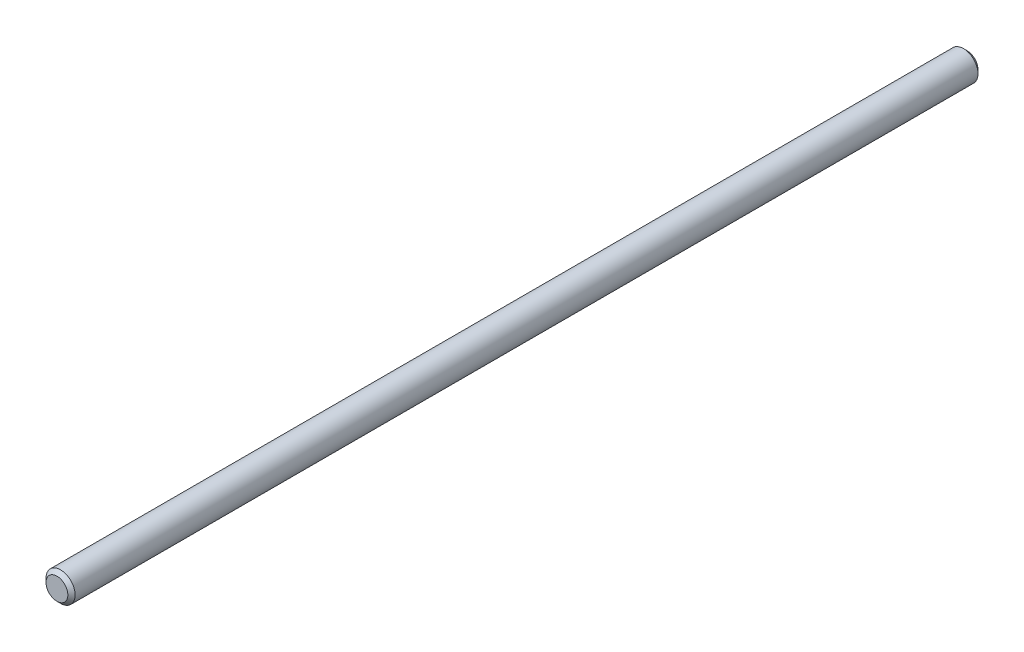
from build123d import *

# Parameters (mm, degrees)
SKETCH_1_R      = 2
EXTRUDE_1_DEPTH = 125
CHAMFER_1_SIZE  = 0.5


with BuildPart() as part:
    # Sketch 1 → Extrude 1 (new body)
    with BuildSketch(Plane.XY):
        Circle(SKETCH_1_R)
    extrude(amount=-EXTRUDE_1_DEPTH)

    # Chamfer 1
    chamfer_1_edges = [part.edges().sort_by_distance(p)[0] for p in [
        (-2, 0, 0),
        (-2, 0, -125),
    ]]
    chamfer(chamfer_1_edges, length=CHAMFER_1_SIZE)


solid = part.part
